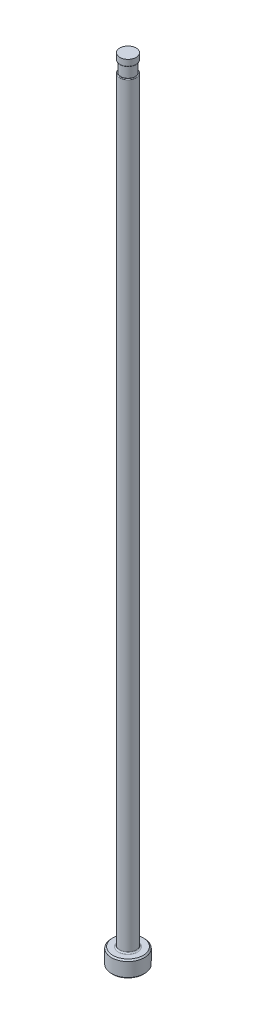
from build123d import *

# Parameters (mm, degrees)
CHAMFER1_SIZE     = 0.254
FILLET1_R         = 0.254
SKETCH2_W         = 0.2032
SKETCH2_H         = 2.032
D_SLOT_DEPTH      = 153.466131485
D_SLOT_DEPTH_BACK = 153.466131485
SKETCH5_W         = 0.0127
SKETCH5_H         = 1.27
FILLET2_R         = 0.127


with BuildPart() as part:
    # Sketch1 → Revolve1 (revolve)
    with BuildSketch(Plane.XY, mode=Mode.PRIVATE) as revolve1_sk:
        Polygon((0, 0), (-3.175, 0), (-3.175, 3.175), (-1.5875, 3.175), (-1.5875, 152.4), (0, 152.4), align=None)
    revolve(revolve1_sk.sketch.rotate(Axis((0, 259.958771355, 0), (0, -1, 0)), 270), axis=Axis((0, 259.958771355, 0), (0, -1, 0)))

    # Chamfer1
    chamfer1_edges = [part.edges().sort_by_distance(p)[0] for p in [
        (0, 3.175, -3.175),
        (0, 0, -3.175),
    ]]
    chamfer(chamfer1_edges, length=CHAMFER1_SIZE)

    # Fillet1
    fillet1_edges = [part.edges().sort_by_distance(p)[0] for p in [
        (0, 3.175, -1.5875),
    ]]
    fillet(fillet1_edges, radius=FILLET1_R)

    # Sketch2 → Vent Relief (revolve, cut)
    with BuildSketch(Plane.XY, mode=Mode.PRIVATE) as vent_relief_sk:
        with Locations((-1.4859, 150.114)):
            Rectangle(SKETCH2_W, SKETCH2_H)
    revolve(vent_relief_sk.sketch.rotate(Axis((0, 153.448281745, 0), (0, -1, 0)), 270), axis=Axis((0, 153.448281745, 0), (0, -1, 0)), mode=Mode.SUBTRACT)

    # Sketch3 → D-Slot (cut, two sides: drawn at the far end of the back side and taken through both)
    with BuildSketch(Plane.XY.offset(-D_SLOT_DEPTH_BACK)):
        with BuildLine():
            Line((-1.3843, 150.114), (-1.3843, 86.614))
            ThreePointArc((-1.3843, 86.614), (-1.435513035, 86.046038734), (-1.5875, 85.4964))
            Line((-1.5875, 85.4964), (-1.5875, 150.114))
            Line((-1.5875, 150.114), (-1.3843, 150.114))
        make_face()
    extrude(amount=D_SLOT_DEPTH + D_SLOT_DEPTH_BACK, mode=Mode.SUBTRACT)

    # Sketch5 → Vent Diameter (revolve, cut)
    with BuildSketch(Plane.XY, mode=Mode.PRIVATE) as vent_diameter_sk:
        with Locations((-1.58115, 151.765)):
            Rectangle(SKETCH5_W, SKETCH5_H)
    revolve(vent_diameter_sk.sketch.rotate(Axis((0, 152.687735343, 0), (0, -1, 0)), 90), axis=Axis((0, 152.687735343, 0), (0, -1, 0)), mode=Mode.SUBTRACT)

    # Fillet2
    fillet2_edges = [part.edges().sort_by_distance(p)[0] for p in [
        (1.369997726, 149.098, -0.802036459),
        (0, 151.13, 1.5748),
    ]]
    fillet(fillet2_edges, radius=FILLET2_R)


solid = part.part
